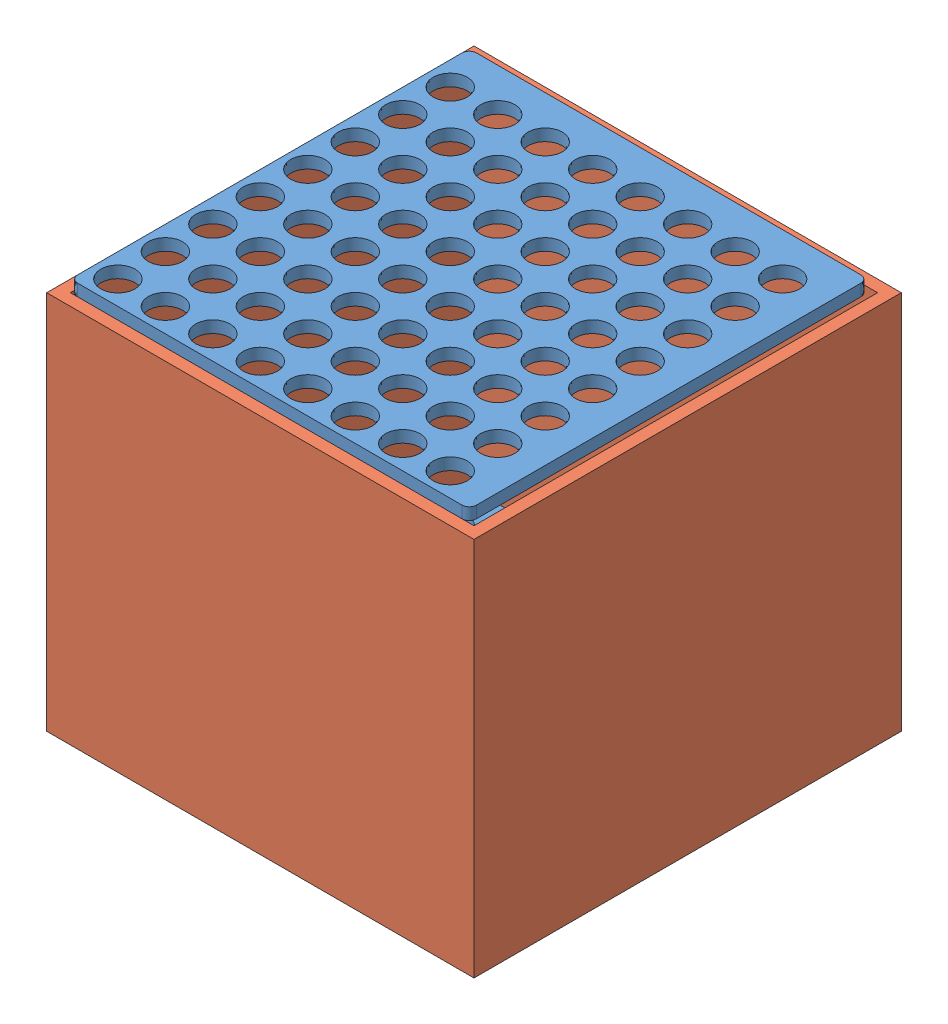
SolidWorks assembly Assem1.sldasm, configuration Default (file format 13000). Lengths in mm.
Overall size (180 165 180).
3 component instances, 2 part files, 7 mates.
Components (placement in the parent):
- Part4-1: Part4.SLDPRT [Default] at (93.2699 94.684 100.5307) size (168 5 168)
- Part4-2: Part4.SLDPRT [Default] at (93.2699 254.684 100.5307) size (168 5 168)
- Part1-1: Part1.SLDPRT [Default] at (4.2699 94.684 189.5307) size (180 160 180)
Mates (geometry in assembly coordinates):
- Coincident10: coincident anti-aligned: plane of Part4-2 through (93.2699 254.684 111.1565) normal (0 -1 0); plane of Part1-1 through (4.2699 254.684 200.1565) normal (0 1 0)
- Coincident13: coincident aligned: line of Part4-2 through (9.2699 254.684 30.1565) axis (0 0 1); line of Part1-1 through (9.2699 254.684 25.1565) axis (0 0 1)
- Coincident14: coincident aligned: line of Part4-2 through (12.2699 254.684 195.1565) axis (1 0 0); line of Part1-1 through (9.2699 254.684 195.1565) axis (1 0 0)
- Coincident15: coincident aligned: plane of Part4-1 through (93.2699 94.684 100.5307) normal (0 -1 0); plane of Part1-1 through (4.2699 94.684 200.1565) normal (0 -1 0)
- Parallel2: parallel aligned: line of Part4-1 through (12.2699 99.684 184.5307) axis (1 0 0); line of Part1-1 through (9.2699 94.684 195.1565) axis (1 0 0)
- Coincident18: coincident anti-aligned: plane of Part4-1 through (9.2699 99.684 184.5307) normal (-1 0 0); plane of Part1-1 through (9.2699 254.684 184.5307) normal (1 0 0)
- Coincident19: coincident anti-aligned: plane of Part4-1 through (9.2699 99.684 184.5307) normal (0 0 1); plane of Part1-1 through (9.2699 254.684 184.5307) normal (0 0 -1)
